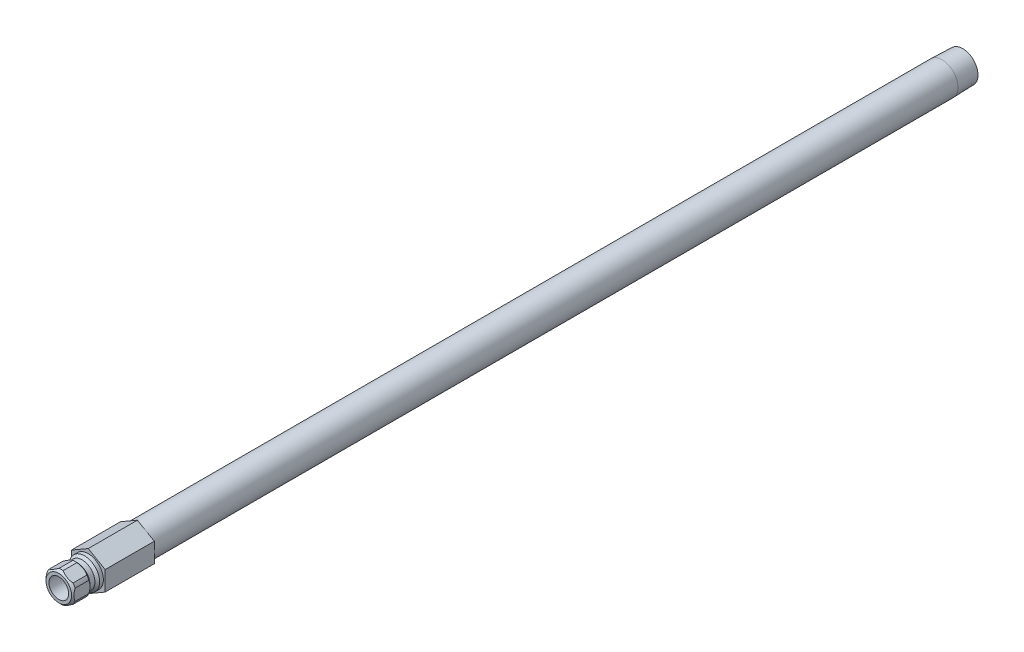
from build123d import *

# Parameters (mm, degrees)
SKETCH2_R           = 2.38125
BOSS_EXTRUDE1_DEPTH = 15.875
CUT_EXTRUDE1_START  = 3.556
SKETCH3_OUTSIDE_W   = 71.438
SKETCH3_OUTSIDE_H   = 73.128
CUT_EXTRUDE1_DEPTH  = 280.142101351


with BuildPart() as part:
    # Sketch1 → Revolve1 (revolve)
    with BuildSketch(Plane(origin=(0, 0, 0), x_dir=(0, 0, -1), z_dir=(1, 0, 0))):
        Polygon((-9.525, 3.175), (-9.525, 4.1275), (-8.763, 4.8895), (-4.318, 4.8895), (-3.556, 4.1275), (-1.9685, 4.1275), (-1.2065, 4.8895), (0, 4.8895), (0, 5.1435), (275.8948, 5.1435), (282.575, 4.934744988), (282.575, 2.38125), (0.127, 2.38125), (0.127, 3.175), align=None)
    revolve(axis=Axis((0, 0, 0), (0, 0, 1)))

    # Sketch2 → Boss-Extrude1 (add)
    with BuildSketch(Plane.XY):
        Polygon((-5.461, 3.15290982), (-5.461, -3.15290982), (0, -6.30581964), (5.461, -3.15290982), (5.461, 3.15290982), (0, 6.30581964), align=None)
        with Locations(Location((0, 0, 0), (0, 0, 90))):
            Circle(SKETCH2_R, mode=Mode.SUBTRACT)
    extrude(amount=-BOSS_EXTRUDE1_DEPTH)

    # Sketch3 outside → Cut-Extrude1 (cut, through all)
    with BuildSketch(Plane.XY.offset(CUT_EXTRUDE1_START)):
        Rectangle(SKETCH3_OUTSIDE_W, SKETCH3_OUTSIDE_H)
        Polygon((-4.5212, -2.610316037), (0, -5.220632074), (4.5212, -2.610316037), (4.5212, 2.610316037), (0, 5.220632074), (-4.5212, 2.610316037), align=None, mode=Mode.SUBTRACT)
    extrude(amount=CUT_EXTRUDE1_DEPTH, mode=Mode.SUBTRACT)


solid = part.part
